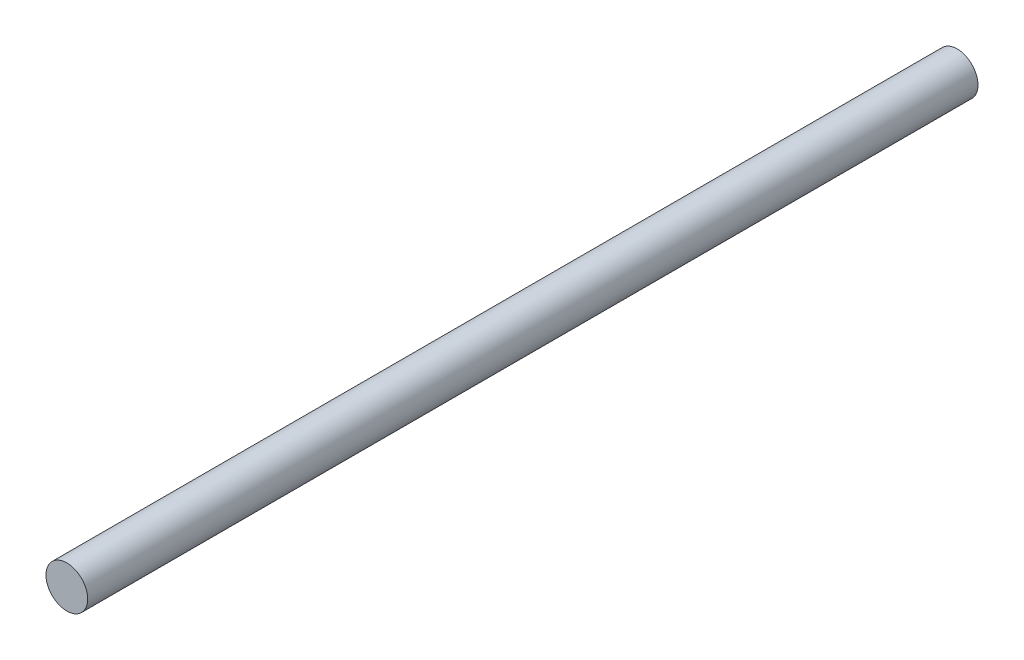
ISO-10303-21;
HEADER;
FILE_DESCRIPTION(('STEP AP214'),'2;1');
FILE_NAME('part.step','',(''),(''),'','','');
FILE_SCHEMA(('AUTOMOTIVE_DESIGN { 1 0 10303 214 1 1 1 1 }'));
ENDSEC;
DATA;
#1=APPLICATION_CONTEXT('core data for automotive mechanical design processes');
#2=APPLICATION_PROTOCOL_DEFINITION('international standard','automotive_design',2000,#1);
#3=PRODUCT_CONTEXT('',#1,'mechanical');
#4=PRODUCT('Part','Part','',(#3));
#5=PRODUCT_RELATED_PRODUCT_CATEGORY('part','',(#4));
#6=PRODUCT_DEFINITION_FORMATION('','',#4);
#7=PRODUCT_DEFINITION_CONTEXT('part definition',#1,'design');
#8=PRODUCT_DEFINITION('design','',#6,#7);
#9=PRODUCT_DEFINITION_SHAPE('','',#8);
#10=(LENGTH_UNIT() NAMED_UNIT(*) SI_UNIT(.MILLI.,.METRE.));
#11=(NAMED_UNIT(*) PLANE_ANGLE_UNIT() SI_UNIT($,.RADIAN.));
#12=(NAMED_UNIT(*) SI_UNIT($,.STERADIAN.) SOLID_ANGLE_UNIT());
#13=UNCERTAINTY_MEASURE_WITH_UNIT(LENGTH_MEASURE(1.E-05),#10,'distance_accuracy_value','');
#14=(GEOMETRIC_REPRESENTATION_CONTEXT(3) GLOBAL_UNCERTAINTY_ASSIGNED_CONTEXT((#13)) GLOBAL_UNIT_ASSIGNED_CONTEXT((#10,
#11,#12)) REPRESENTATION_CONTEXT('',''));
#15=CARTESIAN_POINT('',(0.,0.,0.));
#16=DIRECTION('',(0.,0.,1.));
#17=DIRECTION('',(1.,0.,0.));
#18=AXIS2_PLACEMENT_3D('',#15,#16,#17);
#19=CARTESIAN_POINT('',(0.,0.,25.4));
#20=DIRECTION('',(0.,0.,-1.));
#21=DIRECTION('',(-1.,0.,0.));
#22=AXIS2_PLACEMENT_3D('',#19,#20,#21);
#23=CYLINDRICAL_SURFACE('',#22,1.190625);
#24=CARTESIAN_POINT('',(0.,0.,25.4));
#25=DIRECTION('',(0.,0.,1.));
#26=DIRECTION('',(1.,0.,0.));
#27=AXIS2_PLACEMENT_3D('',#24,#25,#26);
#28=CIRCLE('',#27,1.190625);
#29=CARTESIAN_POINT('',(1.190625,0.,25.4));
#30=VERTEX_POINT('',#29);
#31=EDGE_CURVE('E10',#30,#30,#28,.T.);
#32=ORIENTED_EDGE('',*,*,#31,.F.);
#33=EDGE_LOOP('',(#32));
#34=FACE_BOUND('',#33,.T.);
#35=CARTESIAN_POINT('',(0.,0.,-25.4));
#36=DIRECTION('',(0.,0.,1.));
#37=DIRECTION('',(1.,0.,0.));
#38=AXIS2_PLACEMENT_3D('',#35,#36,#37);
#39=CIRCLE('',#38,1.190625);
#40=CARTESIAN_POINT('',(1.190625,0.,-25.4));
#41=VERTEX_POINT('',#40);
#42=EDGE_CURVE('E37',#41,#41,#39,.T.);
#43=ORIENTED_EDGE('',*,*,#42,.T.);
#44=EDGE_LOOP('',(#43));
#45=FACE_BOUND('',#44,.T.);
#46=ADVANCED_FACE('F34',(#34,#45),#23,.T.);
#47=CARTESIAN_POINT('',(0.,0.,25.4));
#48=DIRECTION('',(0.,0.,1.));
#49=DIRECTION('',(1.,0.,0.));
#50=AXIS2_PLACEMENT_3D('',#47,#48,#49);
#51=PLANE('',#50);
#52=ORIENTED_EDGE('',*,*,#31,.T.);
#53=EDGE_LOOP('',(#52));
#54=FACE_BOUND('',#53,.T.);
#55=ADVANCED_FACE('F49',(#54),#51,.T.);
#56=CARTESIAN_POINT('',(0.,0.,-25.4));
#57=DIRECTION('',(0.,0.,1.));
#58=DIRECTION('',(1.,0.,0.));
#59=AXIS2_PLACEMENT_3D('',#56,#57,#58);
#60=PLANE('',#59);
#61=ORIENTED_EDGE('',*,*,#42,.F.);
#62=EDGE_LOOP('',(#61));
#63=FACE_BOUND('',#62,.T.);
#64=ADVANCED_FACE('F47',(#63),#60,.F.);
#65=CLOSED_SHELL('',(#46,#55,#64));
#66=MANIFOLD_SOLID_BREP('B2',#65);
#67=ADVANCED_BREP_SHAPE_REPRESENTATION('',(#18,#66),#14);
#68=SHAPE_DEFINITION_REPRESENTATION(#9,#67);
ENDSEC;
END-ISO-10303-21;
